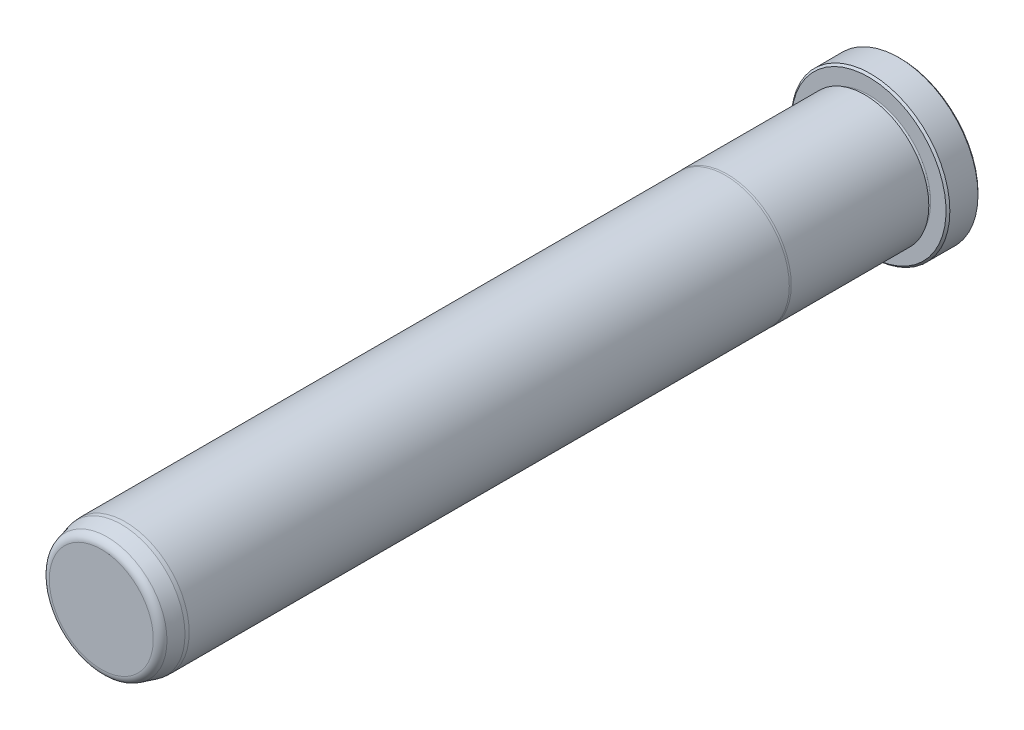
from build123d import *

# Parameters (mm, degrees)
FILLET6_R     = 1.5875
CHAMFER1_SIZE = 0.381


with BuildPart() as part:
    # Sketch1 → Revolve1 (revolve)
    with BuildSketch(Plane(origin=(0, 0, 0), x_dir=(0, 0, -1), z_dir=(1, 0, 0)), mode=Mode.PRIVATE) as revolve1_sk:
        with BuildLine():
            Line((0, 0), (0, 15.748))
            Line((0, 15.748), (-6.35, 15.748))
            Line((-6.35, 15.748), (-6.35, 12.3063))
            ThreePointArc((-6.35, 12.3063), (-6.731, 11.9253), (-7.112, 12.3063))
            Line((-7.112, 12.3063), (-7.112, 12.7127))
            Line((-7.112, 12.7127), (-34.434763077, 12.7127))
            Line((-34.434763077, 12.7127), (-34.798, 12.6873))
            Line((-34.798, 12.6873), (-153.9875, 12.6873))
            Line((-153.9875, 12.6873), (-154.7495, 12.620633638))
            Line((-154.7495, 12.620633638), (-158.75, 11.548702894))
            Line((-158.75, 11.548702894), (-158.75, 0))
            Line((-158.75, 0), (0, 0))
        make_face()
    revolve(revolve1_sk.sketch.rotate(Axis((0, 0, 0), (0, 0, -1)), 90), axis=Axis((0, 0, 0), (0, 0, -1)))

    # Fillet6
    fillet6_edges = [part.edges().sort_by_distance(p)[0] for p in [
        (-11.548702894, 0, 158.75),
    ]]
    fillet(fillet6_edges, radius=FILLET6_R)

    # Chamfer1
    chamfer1_edges = [part.edges().sort_by_distance(p)[0] for p in [
        (-15.748, 0, 6.35),
        (-15.748, 0, 0),
    ]]
    chamfer(chamfer1_edges, length=CHAMFER1_SIZE)


solid = part.part
